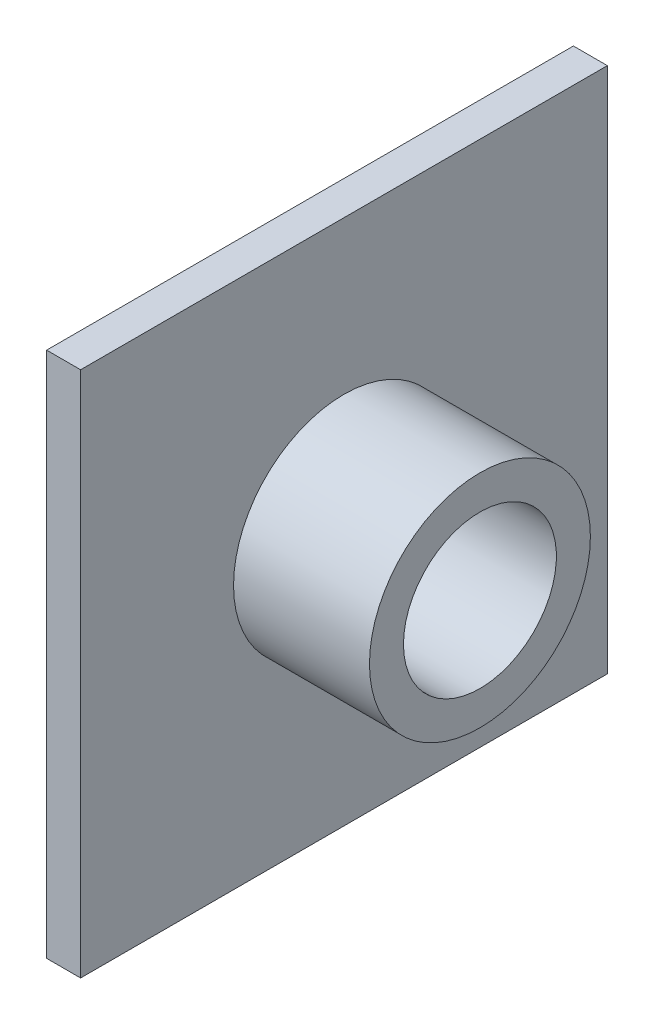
ISO-10303-21;
HEADER;
FILE_DESCRIPTION(('STEP AP214'),'2;1');
FILE_NAME('part.step','',(''),(''),'','','');
FILE_SCHEMA(('AUTOMOTIVE_DESIGN { 1 0 10303 214 1 1 1 1 }'));
ENDSEC;
DATA;
#1=APPLICATION_CONTEXT('core data for automotive mechanical design processes');
#2=APPLICATION_PROTOCOL_DEFINITION('international standard','automotive_design',2000,#1);
#3=PRODUCT_CONTEXT('',#1,'mechanical');
#4=PRODUCT('Part','Part','',(#3));
#5=PRODUCT_RELATED_PRODUCT_CATEGORY('part','',(#4));
#6=PRODUCT_DEFINITION_FORMATION('','',#4);
#7=PRODUCT_DEFINITION_CONTEXT('part definition',#1,'design');
#8=PRODUCT_DEFINITION('design','',#6,#7);
#9=PRODUCT_DEFINITION_SHAPE('','',#8);
#10=(LENGTH_UNIT() NAMED_UNIT(*) SI_UNIT(.MILLI.,.METRE.));
#11=(NAMED_UNIT(*) PLANE_ANGLE_UNIT() SI_UNIT($,.RADIAN.));
#12=(NAMED_UNIT(*) SI_UNIT($,.STERADIAN.) SOLID_ANGLE_UNIT());
#13=UNCERTAINTY_MEASURE_WITH_UNIT(LENGTH_MEASURE(1.E-05),#10,'distance_accuracy_value','');
#14=(GEOMETRIC_REPRESENTATION_CONTEXT(3) GLOBAL_UNCERTAINTY_ASSIGNED_CONTEXT((#13)) GLOBAL_UNIT_ASSIGNED_CONTEXT((#10,
#11,#12)) REPRESENTATION_CONTEXT('',''));
#15=CARTESIAN_POINT('',(0.,0.,0.));
#16=DIRECTION('',(0.,0.,1.));
#17=DIRECTION('',(1.,0.,0.));
#18=AXIS2_PLACEMENT_3D('',#15,#16,#17);
#19=CARTESIAN_POINT('',(4.,31.,31.));
#20=DIRECTION('',(0.,0.,-1.));
#21=DIRECTION('',(0.,1.,0.));
#22=AXIS2_PLACEMENT_3D('',#19,#20,#21);
#23=PLANE('',#22);
#24=DIRECTION('',(0.,-1.,0.));
#25=VECTOR('',#24,1.);
#26=CARTESIAN_POINT('',(0.,31.,31.));
#27=LINE('',#26,#25);
#28=CARTESIAN_POINT('',(0.,31.,31.));
#29=VERTEX_POINT('',#28);
#30=CARTESIAN_POINT('',(0.,-31.,31.));
#31=VERTEX_POINT('',#30);
#32=EDGE_CURVE('E99',#29,#31,#27,.T.);
#33=ORIENTED_EDGE('',*,*,#32,.T.);
#34=DIRECTION('',(-1.,0.,0.));
#35=VECTOR('',#34,1.);
#36=CARTESIAN_POINT('',(4.,-31.,31.));
#37=LINE('',#36,#35);
#38=CARTESIAN_POINT('',(4.,-31.,31.));
#39=VERTEX_POINT('',#38);
#40=EDGE_CURVE('E36',#39,#31,#37,.T.);
#41=ORIENTED_EDGE('',*,*,#40,.F.);
#42=DIRECTION('',(0.,-1.,0.));
#43=VECTOR('',#42,1.);
#44=CARTESIAN_POINT('',(4.,31.,31.));
#45=LINE('',#44,#43);
#46=CARTESIAN_POINT('',(4.,31.,31.));
#47=VERTEX_POINT('',#46);
#48=EDGE_CURVE('E84',#47,#39,#45,.T.);
#49=ORIENTED_EDGE('',*,*,#48,.F.);
#50=DIRECTION('',(-1.,0.,0.));
#51=VECTOR('',#50,1.);
#52=CARTESIAN_POINT('',(4.,31.,31.));
#53=LINE('',#52,#51);
#54=EDGE_CURVE('E50',#47,#29,#53,.T.);
#55=ORIENTED_EDGE('',*,*,#54,.T.);
#56=EDGE_LOOP('',(#33,#41,#49,#55));
#57=FACE_BOUND('',#56,.T.);
#58=ADVANCED_FACE('F33',(#57),#23,.F.);
#59=CARTESIAN_POINT('',(4.,-31.,31.));
#60=DIRECTION('',(0.,1.,0.));
#61=DIRECTION('',(0.,0.,1.));
#62=AXIS2_PLACEMENT_3D('',#59,#60,#61);
#63=PLANE('',#62);
#64=DIRECTION('',(0.,0.,-1.));
#65=VECTOR('',#64,1.);
#66=CARTESIAN_POINT('',(0.,-31.,31.));
#67=LINE('',#66,#65);
#68=CARTESIAN_POINT('',(0.,-31.,-31.));
#69=VERTEX_POINT('',#68);
#70=EDGE_CURVE('E90',#31,#69,#67,.T.);
#71=ORIENTED_EDGE('',*,*,#70,.T.);
#72=DIRECTION('',(-1.,0.,0.));
#73=VECTOR('',#72,1.);
#74=CARTESIAN_POINT('',(4.,-31.,-31.));
#75=LINE('',#74,#73);
#76=CARTESIAN_POINT('',(4.,-31.,-31.));
#77=VERTEX_POINT('',#76);
#78=EDGE_CURVE('E88',#77,#69,#75,.T.);
#79=ORIENTED_EDGE('',*,*,#78,.F.);
#80=DIRECTION('',(0.,0.,-1.));
#81=VECTOR('',#80,1.);
#82=CARTESIAN_POINT('',(4.,-31.,31.));
#83=LINE('',#82,#81);
#84=EDGE_CURVE('E76',#39,#77,#83,.T.);
#85=ORIENTED_EDGE('',*,*,#84,.F.);
#86=ORIENTED_EDGE('',*,*,#40,.T.);
#87=EDGE_LOOP('',(#71,#79,#85,#86));
#88=FACE_BOUND('',#87,.T.);
#89=ADVANCED_FACE('F89',(#88),#63,.F.);
#90=CARTESIAN_POINT('',(4.,31.,-31.));
#91=DIRECTION('',(0.,0.,-1.));
#92=DIRECTION('',(-1.,0.,0.));
#93=AXIS2_PLACEMENT_3D('',#90,#91,#92);
#94=PLANE('',#93);
#95=DIRECTION('',(0.,-1.,0.));
#96=VECTOR('',#95,1.);
#97=CARTESIAN_POINT('',(0.,31.,-31.));
#98=LINE('',#97,#96);
#99=CARTESIAN_POINT('',(0.,31.,-31.));
#100=VERTEX_POINT('',#99);
#101=EDGE_CURVE('E103',#100,#69,#98,.T.);
#102=ORIENTED_EDGE('',*,*,#101,.F.);
#103=DIRECTION('',(-1.,0.,0.));
#104=VECTOR('',#103,1.);
#105=CARTESIAN_POINT('',(4.,31.,-31.));
#106=LINE('',#105,#104);
#107=CARTESIAN_POINT('',(4.,31.,-31.));
#108=VERTEX_POINT('',#107);
#109=EDGE_CURVE('E64',#108,#100,#106,.T.);
#110=ORIENTED_EDGE('',*,*,#109,.F.);
#111=DIRECTION('',(0.,-1.,0.));
#112=VECTOR('',#111,1.);
#113=CARTESIAN_POINT('',(4.,31.,-31.));
#114=LINE('',#113,#112);
#115=EDGE_CURVE('E83',#108,#77,#114,.T.);
#116=ORIENTED_EDGE('',*,*,#115,.T.);
#117=ORIENTED_EDGE('',*,*,#78,.T.);
#118=EDGE_LOOP('',(#102,#110,#116,#117));
#119=FACE_BOUND('',#118,.T.);
#120=ADVANCED_FACE('F93',(#119),#94,.T.);
#121=CARTESIAN_POINT('',(4.,31.,31.));
#122=DIRECTION('',(0.,1.,0.));
#123=DIRECTION('',(0.,0.,1.));
#124=AXIS2_PLACEMENT_3D('',#121,#122,#123);
#125=PLANE('',#124);
#126=DIRECTION('',(0.,0.,-1.));
#127=VECTOR('',#126,1.);
#128=CARTESIAN_POINT('',(0.,31.,31.));
#129=LINE('',#128,#127);
#130=EDGE_CURVE('E105',#29,#100,#129,.T.);
#131=ORIENTED_EDGE('',*,*,#130,.F.);
#132=ORIENTED_EDGE('',*,*,#54,.F.);
#133=DIRECTION('',(0.,0.,-1.));
#134=VECTOR('',#133,1.);
#135=CARTESIAN_POINT('',(4.,31.,31.));
#136=LINE('',#135,#134);
#137=EDGE_CURVE('E94',#47,#108,#136,.T.);
#138=ORIENTED_EDGE('',*,*,#137,.T.);
#139=ORIENTED_EDGE('',*,*,#109,.T.);
#140=EDGE_LOOP('',(#131,#132,#138,#139));
#141=FACE_BOUND('',#140,.T.);
#142=ADVANCED_FACE('F133',(#141),#125,.T.);
#143=CARTESIAN_POINT('',(4.,0.,0.));
#144=DIRECTION('',(1.,0.,0.));
#145=DIRECTION('',(0.,0.,-1.));
#146=AXIS2_PLACEMENT_3D('',#143,#144,#145);
#147=PLANE('',#146);
#148=CARTESIAN_POINT('',(4.,0.,0.));
#149=DIRECTION('',(1.,0.,0.));
#150=DIRECTION('',(0.,0.,-1.));
#151=AXIS2_PLACEMENT_3D('',#148,#149,#150);
#152=CIRCLE('',#151,13.);
#153=CARTESIAN_POINT('',(4.,0.,-13.));
#154=VERTEX_POINT('',#153);
#155=EDGE_CURVE('E11',#154,#154,#152,.T.);
#156=ORIENTED_EDGE('',*,*,#155,.F.);
#157=EDGE_LOOP('',(#156));
#158=FACE_BOUND('',#157,.T.);
#159=ORIENTED_EDGE('',*,*,#48,.T.);
#160=ORIENTED_EDGE('',*,*,#84,.T.);
#161=ORIENTED_EDGE('',*,*,#115,.F.);
#162=ORIENTED_EDGE('',*,*,#137,.F.);
#163=EDGE_LOOP('',(#159,#160,#161,#162));
#164=FACE_BOUND('',#163,.T.);
#165=ADVANCED_FACE('F80',(#158,#164),#147,.T.);
#166=CARTESIAN_POINT('',(0.,0.,0.));
#167=DIRECTION('',(1.,0.,0.));
#168=DIRECTION('',(0.,0.,-1.));
#169=AXIS2_PLACEMENT_3D('',#166,#167,#168);
#170=PLANE('',#169);
#171=CARTESIAN_POINT('',(0.,0.,0.));
#172=DIRECTION('',(-1.,0.,0.));
#173=DIRECTION('',(0.,0.,1.));
#174=AXIS2_PLACEMENT_3D('',#171,#172,#173);
#175=CIRCLE('',#174,9.);
#176=CARTESIAN_POINT('',(0.,0.,9.));
#177=VERTEX_POINT('',#176);
#178=EDGE_CURVE('E114',#177,#177,#175,.T.);
#179=ORIENTED_EDGE('',*,*,#178,.F.);
#180=EDGE_LOOP('',(#179));
#181=FACE_BOUND('',#180,.T.);
#182=ORIENTED_EDGE('',*,*,#32,.F.);
#183=ORIENTED_EDGE('',*,*,#130,.T.);
#184=ORIENTED_EDGE('',*,*,#101,.T.);
#185=ORIENTED_EDGE('',*,*,#70,.F.);
#186=EDGE_LOOP('',(#182,#183,#184,#185));
#187=FACE_BOUND('',#186,.T.);
#188=ADVANCED_FACE('F129',(#181,#187),#170,.F.);
#189=CARTESIAN_POINT('',(20.,0.,0.));
#190=DIRECTION('',(-1.,0.,0.));
#191=DIRECTION('',(0.,0.,1.));
#192=AXIS2_PLACEMENT_3D('',#189,#190,#191);
#193=CYLINDRICAL_SURFACE('',#192,13.);
#194=ORIENTED_EDGE('',*,*,#155,.T.);
#195=EDGE_LOOP('',(#194));
#196=FACE_BOUND('',#195,.T.);
#197=CARTESIAN_POINT('',(20.,0.,0.));
#198=DIRECTION('',(-1.,0.,0.));
#199=DIRECTION('',(0.,0.,1.));
#200=AXIS2_PLACEMENT_3D('',#197,#198,#199);
#201=CIRCLE('',#200,13.);
#202=CARTESIAN_POINT('',(20.,0.,13.));
#203=VERTEX_POINT('',#202);
#204=EDGE_CURVE('E101',#203,#203,#201,.T.);
#205=ORIENTED_EDGE('',*,*,#204,.T.);
#206=EDGE_LOOP('',(#205));
#207=FACE_BOUND('',#206,.T.);
#208=ADVANCED_FACE('F131',(#196,#207),#193,.T.);
#209=CARTESIAN_POINT('',(20.,0.,0.));
#210=DIRECTION('',(-1.,0.,0.));
#211=DIRECTION('',(0.,0.,1.));
#212=AXIS2_PLACEMENT_3D('',#209,#210,#211);
#213=PLANE('',#212);
#214=CARTESIAN_POINT('',(20.,0.,0.));
#215=DIRECTION('',(-1.,0.,0.));
#216=DIRECTION('',(0.,0.,1.));
#217=AXIS2_PLACEMENT_3D('',#214,#215,#216);
#218=CIRCLE('',#217,9.);
#219=CARTESIAN_POINT('',(20.,0.,9.));
#220=VERTEX_POINT('',#219);
#221=EDGE_CURVE('E113',#220,#220,#218,.T.);
#222=ORIENTED_EDGE('',*,*,#221,.T.);
#223=EDGE_LOOP('',(#222));
#224=FACE_BOUND('',#223,.T.);
#225=ORIENTED_EDGE('',*,*,#204,.F.);
#226=EDGE_LOOP('',(#225));
#227=FACE_BOUND('',#226,.T.);
#228=ADVANCED_FACE('F120',(#224,#227),#213,.F.);
#229=CARTESIAN_POINT('',(20.,0.,0.));
#230=DIRECTION('',(-1.,0.,0.));
#231=DIRECTION('',(0.,0.,1.));
#232=AXIS2_PLACEMENT_3D('',#229,#230,#231);
#233=CYLINDRICAL_SURFACE('',#232,9.);
#234=ORIENTED_EDGE('',*,*,#221,.F.);
#235=EDGE_LOOP('',(#234));
#236=FACE_BOUND('',#235,.T.);
#237=ORIENTED_EDGE('',*,*,#178,.T.);
#238=EDGE_LOOP('',(#237));
#239=FACE_BOUND('',#238,.T.);
#240=ADVANCED_FACE('F123',(#236,#239),#233,.F.);
#241=CLOSED_SHELL('',(#58,#89,#120,#142,#165,#188,#208,#228,#240));
#242=MANIFOLD_SOLID_BREP('B2',#241);
#243=ADVANCED_BREP_SHAPE_REPRESENTATION('',(#18,#242),#14);
#244=SHAPE_DEFINITION_REPRESENTATION(#9,#243);
ENDSEC;
END-ISO-10303-21;
